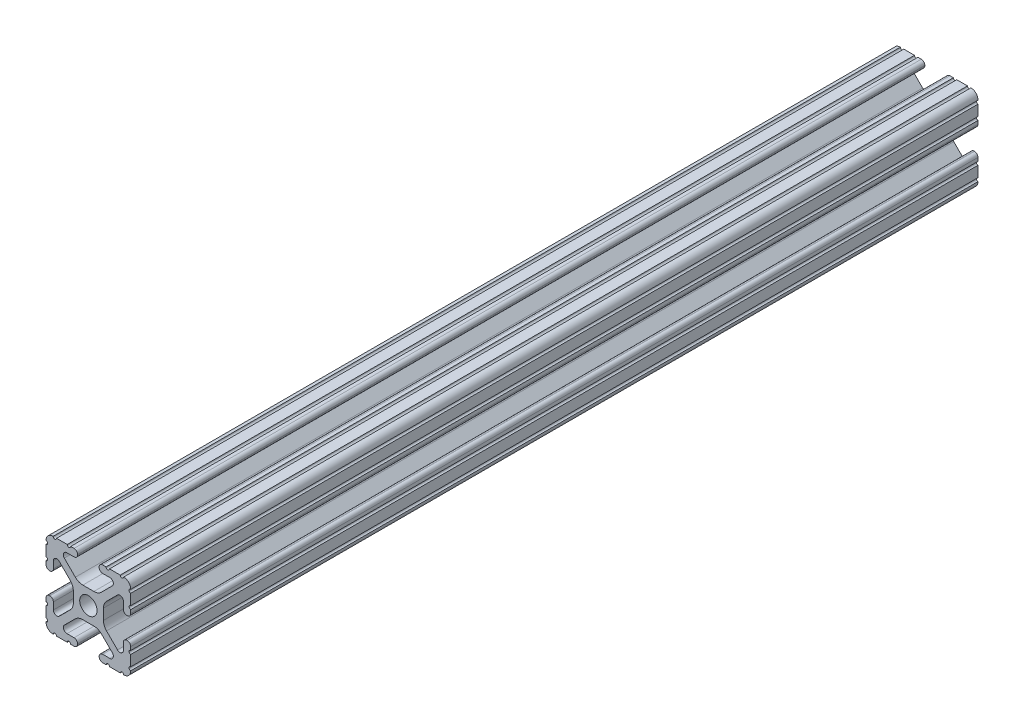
from build123d import *

# Parameters (mm, degrees)
SKETCH1_R      = 2.6035
EXTRUDE1_DEPTH = 254


with BuildPart() as part:
    # Sketch1 → Extrude1 (new body)
    with BuildSketch(Plane.XY):
        with BuildLine():
            Line((-7.207036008, 8.724370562), (-3.898272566, 5.423169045))
            ThreePointArc((-3.898272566, 5.423169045), (-2.869120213, 4.736787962), (-1.655778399, 4.4958))
            Line((-1.655778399, 4.4958), (1.655778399, 4.4958))
            ThreePointArc((1.655778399, 4.4958), (2.869120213, 4.736787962), (3.898272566, 5.423169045))
            Line((3.898272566, 5.423169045), (7.207036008, 8.724370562))
            ThreePointArc((7.207036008, 8.724370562), (7.432222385, 9.85140422), (6.476788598, 10.4902))
            Line((6.476788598, 10.4902), (4.287512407, 10.4902))
            ThreePointArc((4.287512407, 10.4902), (3.54574862, 10.79744862), (3.2385, 11.539212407))
            Line((3.2385, 11.539212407), (3.2385, 11.650987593))
            ThreePointArc((3.2385, 11.650987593), (3.54574862, 12.39275138), (4.287512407, 12.7))
            Line((4.287512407, 12.7), (5.317126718, 12.7))
            ThreePointArc((5.317126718, 12.7), (5.825126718, 12.192), (6.333126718, 12.7))
            Line((6.333126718, 12.7), (9.550443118, 12.7))
            ThreePointArc((9.550443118, 12.7), (10.058366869, 12.192000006), (10.566443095, 12.699847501))
            ThreePointArc((10.566443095, 12.699847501), (12.082537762, 12.08250727), (12.699846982, 10.566399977))
            ThreePointArc((12.699846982, 10.566399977), (12.192000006, 10.058323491), (12.7, 9.5504))
            Line((12.7, 9.5504), (12.7, 6.3330836))
            ThreePointArc((12.7, 6.3330836), (12.192, 5.8250836), (12.7, 5.3170836))
            Line((12.7, 5.3170836), (12.7, 4.287469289))
            ThreePointArc((12.7, 4.287469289), (12.39275138, 3.545705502), (11.650987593, 3.238456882))
            Line((11.650987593, 3.238456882), (11.539212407, 3.238456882))
            ThreePointArc((11.539212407, 3.238456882), (10.79744862, 3.545705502), (10.4902, 4.287469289))
            Line((10.4902, 4.287469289), (10.4902, 6.402089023))
            ThreePointArc((10.4902, 6.402089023), (9.856505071, 7.351067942), (8.737131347, 7.129408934))
            Line((8.737131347, 7.129408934), (5.441005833, 3.840816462))
            ThreePointArc((5.441005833, 3.840816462), (4.750877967, 2.809883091), (4.5085, 1.593185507))
            Line((4.5085, 1.593185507), (4.5085, -1.593185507))
            ThreePointArc((4.5085, -1.593185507), (4.750877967, -2.809883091), (5.441005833, -3.840816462))
            Line((5.441005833, -3.840816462), (8.737131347, -7.129408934))
            ThreePointArc((8.737131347, -7.129408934), (9.856505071, -7.351067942), (10.4902, -6.402089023))
            Line((10.4902, -6.402089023), (10.4902, -4.287469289))
            ThreePointArc((10.4902, -4.287469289), (10.79744862, -3.545705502), (11.539212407, -3.238456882))
            Line((11.539212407, -3.238456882), (11.650987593, -3.238456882))
            ThreePointArc((11.650987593, -3.238456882), (12.39275138, -3.545705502), (12.7, -4.287469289))
            Line((12.7, -4.287469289), (12.7, -5.3170836))
            ThreePointArc((12.7, -5.3170836), (12.192, -5.8250836), (12.7, -6.3330836))
            Line((12.7, -6.3330836), (12.7, -9.5504))
            ThreePointArc((12.7, -9.5504), (12.192000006, -10.058323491), (12.699846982, -10.566399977))
            ThreePointArc((12.699846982, -10.566399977), (12.082537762, -12.08250727), (10.566443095, -12.699847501))
            ThreePointArc((10.566443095, -12.699847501), (10.058366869, -12.192000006), (9.550443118, -12.7))
            Line((9.550443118, -12.7), (6.333126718, -12.7))
            ThreePointArc((6.333126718, -12.7), (5.825126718, -12.192), (5.317126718, -12.7))
            Line((5.317126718, -12.7), (4.287512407, -12.7))
            ThreePointArc((4.287512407, -12.7), (3.54574862, -12.39275138), (3.2385, -11.650987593))
            Line((3.2385, -11.650987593), (3.2385, -11.539212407))
            ThreePointArc((3.2385, -11.539212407), (3.54574862, -10.79744862), (4.287512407, -10.4902))
            Line((4.287512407, -10.4902), (6.416408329, -10.4902))
            ThreePointArc((6.416408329, -10.4902), (7.41473083, -9.822813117), (7.179650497, -8.645192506))
            Line((7.179650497, -8.645192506), (3.952270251, -5.423690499))
            ThreePointArc((3.952270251, -5.423690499), (2.922936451, -4.736929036), (1.709253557, -4.4958))
            Line((1.709253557, -4.4958), (-1.709253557, -4.4958))
            ThreePointArc((-1.709253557, -4.4958), (-2.922936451, -4.736929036), (-3.952270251, -5.423690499))
            Line((-3.952270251, -5.423690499), (-7.179650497, -8.645192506))
            ThreePointArc((-7.179650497, -8.645192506), (-7.41473083, -9.822813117), (-6.416408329, -10.4902))
            Line((-6.416408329, -10.4902), (-4.287512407, -10.4902))
            ThreePointArc((-4.287512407, -10.4902), (-3.54574862, -10.79744862), (-3.2385, -11.539212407))
            Line((-3.2385, -11.539212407), (-3.2385, -11.650987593))
            ThreePointArc((-3.2385, -11.650987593), (-3.54574862, -12.39275138), (-4.287512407, -12.7))
            Line((-4.287512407, -12.7), (-5.317126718, -12.7))
            ThreePointArc((-5.317126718, -12.7), (-5.825126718, -12.192), (-6.333126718, -12.7))
            Line((-6.333126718, -12.7), (-9.550443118, -12.7))
            ThreePointArc((-9.550443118, -12.7), (-10.058366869, -12.192000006), (-10.566443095, -12.699847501))
            ThreePointArc((-10.566443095, -12.699847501), (-12.082537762, -12.08250727), (-12.699846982, -10.566399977))
            ThreePointArc((-12.699846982, -10.566399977), (-12.192000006, -10.058323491), (-12.7, -9.5504))
            Line((-12.7, -9.5504), (-12.7, -6.3330836))
            ThreePointArc((-12.7, -6.3330836), (-12.192, -5.8250836), (-12.7, -5.3170836))
            Line((-12.7, -5.3170836), (-12.7, -4.287469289))
            ThreePointArc((-12.7, -4.287469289), (-12.39275138, -3.545705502), (-11.650987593, -3.238456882))
            Line((-11.650987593, -3.238456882), (-11.539212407, -3.238456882))
            ThreePointArc((-11.539212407, -3.238456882), (-10.79744862, -3.545705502), (-10.4902, -4.287469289))
            Line((-10.4902, -4.287469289), (-10.4902, -6.402089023))
            ThreePointArc((-10.4902, -6.402089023), (-9.856505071, -7.351067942), (-8.737131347, -7.129408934))
            Line((-8.737131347, -7.129408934), (-5.441005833, -3.840816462))
            ThreePointArc((-5.441005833, -3.840816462), (-4.750877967, -2.809883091), (-4.5085, -1.593185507))
            Line((-4.5085, -1.593185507), (-4.5085, 1.593185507))
            ThreePointArc((-4.5085, 1.593185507), (-4.750877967, 2.809883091), (-5.441005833, 3.840816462))
            Line((-5.441005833, 3.840816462), (-8.737131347, 7.129408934))
            ThreePointArc((-8.737131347, 7.129408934), (-9.856505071, 7.351067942), (-10.4902, 6.402089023))
            Line((-10.4902, 6.402089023), (-10.4902, 4.287469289))
            ThreePointArc((-10.4902, 4.287469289), (-10.79744862, 3.545705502), (-11.539212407, 3.238456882))
            Line((-11.539212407, 3.238456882), (-11.650987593, 3.238456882))
            ThreePointArc((-11.650987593, 3.238456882), (-12.39275138, 3.545705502), (-12.7, 4.287469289))
            Line((-12.7, 4.287469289), (-12.7, 5.3170836))
            ThreePointArc((-12.7, 5.3170836), (-12.192, 5.8250836), (-12.7, 6.3330836))
            Line((-12.7, 6.3330836), (-12.7, 9.5504))
            ThreePointArc((-12.7, 9.5504), (-12.192000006, 10.058323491), (-12.699846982, 10.566399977))
            ThreePointArc((-12.699846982, 10.566399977), (-12.082537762, 12.08250727), (-10.566443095, 12.699847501))
            ThreePointArc((-10.566443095, 12.699847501), (-10.058366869, 12.192000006), (-9.550443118, 12.7))
            Line((-9.550443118, 12.7), (-6.333126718, 12.7))
            ThreePointArc((-6.333126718, 12.7), (-5.825126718, 12.192), (-5.317126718, 12.7))
            Line((-5.317126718, 12.7), (-4.287512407, 12.7))
            ThreePointArc((-4.287512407, 12.7), (-3.54574862, 12.39275138), (-3.2385, 11.650987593))
            Line((-3.2385, 11.650987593), (-3.2385, 11.539212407))
            ThreePointArc((-3.2385, 11.539212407), (-3.54574862, 10.79744862), (-4.287512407, 10.4902))
            Line((-4.287512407, 10.4902), (-6.476788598, 10.4902))
            ThreePointArc((-6.476788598, 10.4902), (-7.432222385, 9.85140422), (-7.207036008, 8.724370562))
        make_face()
        Circle(SKETCH1_R, mode=Mode.SUBTRACT)
    extrude(amount=-EXTRUDE1_DEPTH)


solid = part.part
